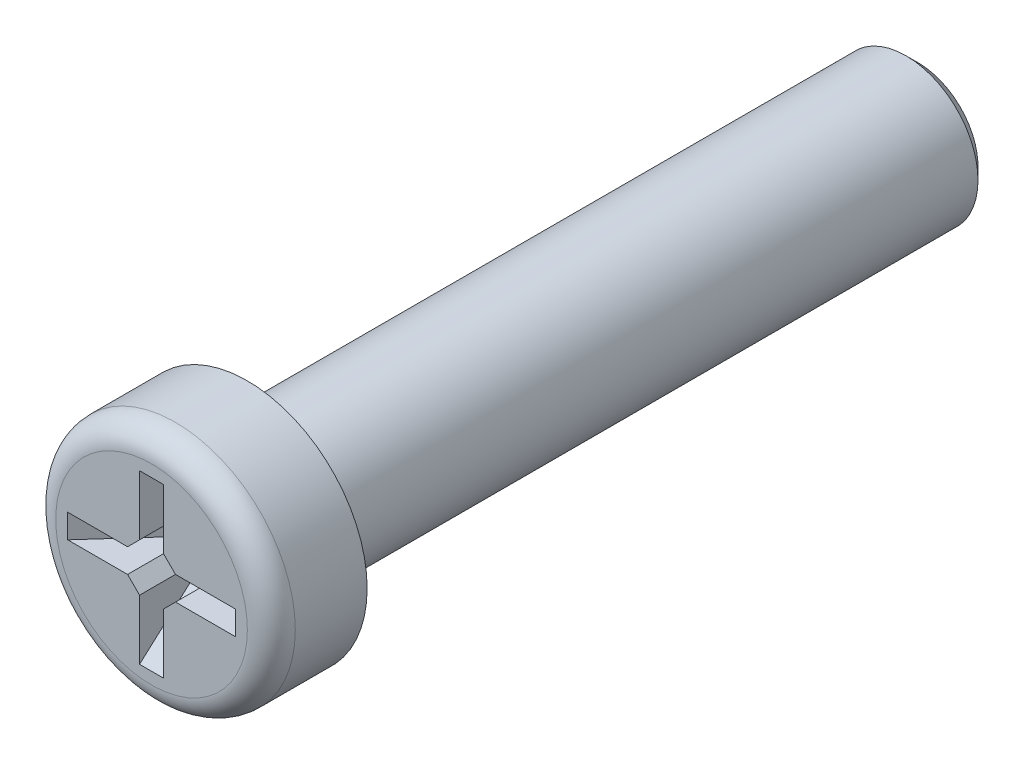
ISO-10303-21;
HEADER;
FILE_DESCRIPTION(('STEP AP214'),'2;1');
FILE_NAME('part.step','',(''),(''),'','','');
FILE_SCHEMA(('AUTOMOTIVE_DESIGN { 1 0 10303 214 1 1 1 1 }'));
ENDSEC;
DATA;
#1=APPLICATION_CONTEXT('core data for automotive mechanical design processes');
#2=APPLICATION_PROTOCOL_DEFINITION('international standard','automotive_design',2000,#1);
#3=PRODUCT_CONTEXT('',#1,'mechanical');
#4=PRODUCT('Part','Part','',(#3));
#5=PRODUCT_RELATED_PRODUCT_CATEGORY('part','',(#4));
#6=PRODUCT_DEFINITION_FORMATION('','',#4);
#7=PRODUCT_DEFINITION_CONTEXT('part definition',#1,'design');
#8=PRODUCT_DEFINITION('design','',#6,#7);
#9=PRODUCT_DEFINITION_SHAPE('','',#8);
#10=(LENGTH_UNIT() NAMED_UNIT(*) SI_UNIT(.MILLI.,.METRE.));
#11=(NAMED_UNIT(*) PLANE_ANGLE_UNIT() SI_UNIT($,.RADIAN.));
#12=(NAMED_UNIT(*) SI_UNIT($,.STERADIAN.) SOLID_ANGLE_UNIT());
#13=UNCERTAINTY_MEASURE_WITH_UNIT(LENGTH_MEASURE(1.E-05),#10,'distance_accuracy_value','');
#14=(GEOMETRIC_REPRESENTATION_CONTEXT(3) GLOBAL_UNCERTAINTY_ASSIGNED_CONTEXT((#13)) GLOBAL_UNIT_ASSIGNED_CONTEXT((#10,
#11,#12)) REPRESENTATION_CONTEXT('',''));
#15=CARTESIAN_POINT('',(0.,0.,0.));
#16=DIRECTION('',(0.,0.,1.));
#17=DIRECTION('',(1.,0.,0.));
#18=AXIS2_PLACEMENT_3D('',#15,#16,#17);
#19=CARTESIAN_POINT('',(1.75,0.25,2.));
#20=DIRECTION('',(-0.743144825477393,0.,0.669130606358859));
#21=DIRECTION('',(0.669130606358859,0.,0.743144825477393));
#22=AXIS2_PLACEMENT_3D('',#19,#20,#21);
#23=PLANE('',#22);
#24=DIRECTION('',(-0.669130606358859,0.,-0.743144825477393));
#25=VECTOR('',#24,1.);
#26=CARTESIAN_POINT('',(1.75,0.25,2.));
#27=LINE('',#26,#25);
#28=CARTESIAN_POINT('',(0.500000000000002,0.249999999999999,0.611734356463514));
#29=VERTEX_POINT('',#28);
#30=CARTESIAN_POINT('',(1.75,0.25,2.));
#31=VERTEX_POINT('',#30);
#32=EDGE_CURVE('E221',#29,#31,#27,.F.);
#33=ORIENTED_EDGE('',*,*,#32,.F.);
#34=DIRECTION('',(-0.556117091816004,0.556117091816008,-0.617630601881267));
#35=VECTOR('',#34,1.);
#36=CARTESIAN_POINT('',(1.36341722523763,-0.61341722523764,1.57065633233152));
#37=LINE('',#36,#35);
#38=CARTESIAN_POINT('',(0.375000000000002,0.375,0.472907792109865));
#39=VERTEX_POINT('',#38);
#40=EDGE_CURVE('E268',#29,#39,#37,.T.);
#41=ORIENTED_EDGE('',*,*,#40,.T.);
#42=DIRECTION('',(-0.556117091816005,-0.556117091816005,-0.617630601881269));
#43=VECTOR('',#42,1.);
#44=CARTESIAN_POINT('',(1.13146756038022,1.13146756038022,1.31305013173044));
#45=LINE('',#44,#43);
#46=CARTESIAN_POINT('',(0.0392323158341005,0.0392323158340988,0.1));
#47=VERTEX_POINT('',#46);
#48=EDGE_CURVE('E240',#39,#47,#45,.T.);
#49=ORIENTED_EDGE('',*,*,#48,.T.);
#50=DIRECTION('',(0.,-1.,0.));
#51=VECTOR('',#50,1.);
#52=CARTESIAN_POINT('',(0.0392323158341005,-0.249999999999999,0.1));
#53=LINE('',#52,#51);
#54=CARTESIAN_POINT('',(0.0392323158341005,-0.0392323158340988,0.1));
#55=VERTEX_POINT('',#54);
#56=EDGE_CURVE('E224',#55,#47,#53,.F.);
#57=ORIENTED_EDGE('',*,*,#56,.F.);
#58=DIRECTION('',(-0.556117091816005,0.556117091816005,-0.617630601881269));
#59=VECTOR('',#58,1.);
#60=CARTESIAN_POINT('',(1.13146756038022,-1.13146756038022,1.31305013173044));
#61=LINE('',#60,#59);
#62=CARTESIAN_POINT('',(0.375000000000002,-0.375,0.472907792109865));
#63=VERTEX_POINT('',#62);
#64=EDGE_CURVE('E55',#63,#55,#61,.T.);
#65=ORIENTED_EDGE('',*,*,#64,.F.);
#66=DIRECTION('',(0.556117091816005,0.556117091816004,0.617630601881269));
#67=VECTOR('',#66,1.);
#68=CARTESIAN_POINT('',(1.51805033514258,0.768050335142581,1.74239379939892));
#69=LINE('',#68,#67);
#70=CARTESIAN_POINT('',(0.500000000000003,-0.249999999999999,0.611734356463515));
#71=VERTEX_POINT('',#70);
#72=EDGE_CURVE('E279',#63,#71,#69,.T.);
#73=ORIENTED_EDGE('',*,*,#72,.T.);
#74=DIRECTION('',(-0.669130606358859,0.,-0.743144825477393));
#75=VECTOR('',#74,1.);
#76=CARTESIAN_POINT('',(0.133600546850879,-0.249999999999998,0.204806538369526));
#77=LINE('',#76,#75);
#78=CARTESIAN_POINT('',(1.75,-0.25,2.));
#79=VERTEX_POINT('',#78);
#80=EDGE_CURVE('E226',#71,#79,#77,.F.);
#81=ORIENTED_EDGE('',*,*,#80,.T.);
#82=DIRECTION('',(0.,1.,0.));
#83=VECTOR('',#82,1.);
#84=CARTESIAN_POINT('',(1.75,0.25,2.));
#85=LINE('',#84,#83);
#86=EDGE_CURVE('E188',#79,#31,#85,.T.);
#87=ORIENTED_EDGE('',*,*,#86,.T.);
#88=EDGE_LOOP('',(#33,#41,#49,#57,#65,#73,#81,#87));
#89=FACE_BOUND('',#88,.T.);
#90=ADVANCED_FACE('F32',(#89),#23,.T.);
#91=CARTESIAN_POINT('',(-0.250000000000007,1.75,2.));
#92=DIRECTION('',(0.,-0.743144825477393,0.669130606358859));
#93=DIRECTION('',(0.,-0.669130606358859,-0.743144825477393));
#94=AXIS2_PLACEMENT_3D('',#91,#92,#93);
#95=PLANE('',#94);
#96=ORIENTED_EDGE('',*,*,#48,.F.);
#97=DIRECTION('',(-0.556117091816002,0.556117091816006,0.61763060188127));
#98=VECTOR('',#97,1.);
#99=CARTESIAN_POINT('',(-0.768050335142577,1.51805033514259,1.74239379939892));
#100=LINE('',#99,#98);
#101=CARTESIAN_POINT('',(0.250000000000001,0.500000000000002,0.611734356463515));
#102=VERTEX_POINT('',#101);
#103=EDGE_CURVE('E271',#39,#102,#100,.T.);
#104=ORIENTED_EDGE('',*,*,#103,.T.);
#105=DIRECTION('',(0.,-0.669130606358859,-0.743144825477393));
#106=VECTOR('',#105,1.);
#107=CARTESIAN_POINT('',(0.250000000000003,0.80520419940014,0.950697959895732));
#108=LINE('',#107,#106);
#109=CARTESIAN_POINT('',(0.250000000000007,1.75,2.));
#110=VERTEX_POINT('',#109);
#111=EDGE_CURVE('E219',#102,#110,#108,.F.);
#112=ORIENTED_EDGE('',*,*,#111,.T.);
#113=DIRECTION('',(-1.,0.,0.));
#114=VECTOR('',#113,1.);
#115=CARTESIAN_POINT('',(-0.250000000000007,1.75,2.));
#116=LINE('',#115,#114);
#117=CARTESIAN_POINT('',(-0.250000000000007,1.75,2.));
#118=VERTEX_POINT('',#117);
#119=EDGE_CURVE('E197',#110,#118,#116,.T.);
#120=ORIENTED_EDGE('',*,*,#119,.T.);
#121=DIRECTION('',(0.,-0.669130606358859,-0.743144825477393));
#122=VECTOR('',#121,1.);
#123=CARTESIAN_POINT('',(-0.250000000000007,1.75,2.));
#124=LINE('',#123,#122);
#125=CARTESIAN_POINT('',(-0.250000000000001,0.5,0.611734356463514));
#126=VERTEX_POINT('',#125);
#127=EDGE_CURVE('E205',#126,#118,#124,.F.);
#128=ORIENTED_EDGE('',*,*,#127,.F.);
#129=DIRECTION('',(-0.556117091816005,-0.556117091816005,-0.617630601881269));
#130=VECTOR('',#129,1.);
#131=CARTESIAN_POINT('',(0.613417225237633,1.36341722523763,1.57065633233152));
#132=LINE('',#131,#130);
#133=CARTESIAN_POINT('',(-0.375000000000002,0.375,0.472907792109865));
#134=VERTEX_POINT('',#133);
#135=EDGE_CURVE('E273',#126,#134,#132,.T.);
#136=ORIENTED_EDGE('',*,*,#135,.T.);
#137=DIRECTION('',(0.556117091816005,-0.556117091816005,-0.617630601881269));
#138=VECTOR('',#137,1.);
#139=CARTESIAN_POINT('',(-1.28610067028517,1.28610067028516,1.48478759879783));
#140=LINE('',#139,#138);
#141=CARTESIAN_POINT('',(-0.0392323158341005,0.0392323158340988,0.1));
#142=VERTEX_POINT('',#141);
#143=EDGE_CURVE('E237',#134,#142,#140,.T.);
#144=ORIENTED_EDGE('',*,*,#143,.T.);
#145=DIRECTION('',(1.,0.,0.));
#146=VECTOR('',#145,1.);
#147=CARTESIAN_POINT('',(-0.249999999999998,0.0392323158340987,0.1));
#148=LINE('',#147,#146);
#149=EDGE_CURVE('E158',#47,#142,#148,.F.);
#150=ORIENTED_EDGE('',*,*,#149,.F.);
#151=EDGE_LOOP('',(#96,#104,#112,#120,#128,#136,#144,#150));
#152=FACE_BOUND('',#151,.T.);
#153=ADVANCED_FACE('F34',(#152),#95,.T.);
#154=CARTESIAN_POINT('',(-0.250000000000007,-1.75,2.));
#155=DIRECTION('',(0.,0.743144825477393,0.669130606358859));
#156=DIRECTION('',(0.,-0.669130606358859,0.743144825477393));
#157=AXIS2_PLACEMENT_3D('',#154,#155,#156);
#158=PLANE('',#157);
#159=DIRECTION('',(0.,0.669130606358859,-0.743144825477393));
#160=VECTOR('',#159,1.);
#161=CARTESIAN_POINT('',(0.250000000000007,-1.75,2.));
#162=LINE('',#161,#160);
#163=CARTESIAN_POINT('',(0.250000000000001,-0.5,0.611734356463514));
#164=VERTEX_POINT('',#163);
#165=CARTESIAN_POINT('',(0.250000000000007,-1.75,2.));
#166=VERTEX_POINT('',#165);
#167=EDGE_CURVE('E228',#164,#166,#162,.F.);
#168=ORIENTED_EDGE('',*,*,#167,.F.);
#169=DIRECTION('',(0.556117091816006,0.556117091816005,-0.617630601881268));
#170=VECTOR('',#169,1.);
#171=CARTESIAN_POINT('',(-0.768050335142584,-1.51805033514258,1.74239379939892));
#172=LINE('',#171,#170);
#173=EDGE_CURVE('E277',#164,#63,#172,.T.);
#174=ORIENTED_EDGE('',*,*,#173,.T.);
#175=ORIENTED_EDGE('',*,*,#64,.T.);
#176=DIRECTION('',(-1.,0.,0.));
#177=VECTOR('',#176,1.);
#178=CARTESIAN_POINT('',(-0.249999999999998,-0.0392323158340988,0.1));
#179=LINE('',#178,#177);
#180=CARTESIAN_POINT('',(-0.0392323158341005,-0.0392323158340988,0.1));
#181=VERTEX_POINT('',#180);
#182=EDGE_CURVE('E216',#181,#55,#179,.F.);
#183=ORIENTED_EDGE('',*,*,#182,.F.);
#184=DIRECTION('',(0.556117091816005,0.556117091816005,-0.617630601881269));
#185=VECTOR('',#184,1.);
#186=CARTESIAN_POINT('',(-1.28610067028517,-1.28610067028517,1.48478759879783));
#187=LINE('',#186,#185);
#188=CARTESIAN_POINT('',(-0.375000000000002,-0.375,0.472907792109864));
#189=VERTEX_POINT('',#188);
#190=EDGE_CURVE('E47',#189,#181,#187,.T.);
#191=ORIENTED_EDGE('',*,*,#190,.F.);
#192=DIRECTION('',(0.556117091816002,-0.556117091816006,0.61763060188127));
#193=VECTOR('',#192,1.);
#194=CARTESIAN_POINT('',(0.613417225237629,-1.36341722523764,1.57065633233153));
#195=LINE('',#194,#193);
#196=CARTESIAN_POINT('',(-0.250000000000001,-0.500000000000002,0.611734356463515));
#197=VERTEX_POINT('',#196);
#198=EDGE_CURVE('E283',#189,#197,#195,.T.);
#199=ORIENTED_EDGE('',*,*,#198,.T.);
#200=DIRECTION('',(0.,0.669130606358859,-0.743144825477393));
#201=VECTOR('',#200,1.);
#202=CARTESIAN_POINT('',(-0.25,-0.133600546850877,0.204806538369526));
#203=LINE('',#202,#201);
#204=CARTESIAN_POINT('',(-0.250000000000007,-1.75,2.));
#205=VERTEX_POINT('',#204);
#206=EDGE_CURVE('E218',#197,#205,#203,.F.);
#207=ORIENTED_EDGE('',*,*,#206,.T.);
#208=DIRECTION('',(1.,0.,0.));
#209=VECTOR('',#208,1.);
#210=CARTESIAN_POINT('',(-0.250000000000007,-1.75,2.));
#211=LINE('',#210,#209);
#212=EDGE_CURVE('E179',#205,#166,#211,.T.);
#213=ORIENTED_EDGE('',*,*,#212,.T.);
#214=EDGE_LOOP('',(#168,#174,#175,#183,#191,#199,#207,#213));
#215=FACE_BOUND('',#214,.T.);
#216=ADVANCED_FACE('F305',(#215),#158,.T.);
#217=CARTESIAN_POINT('',(-1.75,0.25,2.));
#218=DIRECTION('',(0.743144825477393,0.,0.669130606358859));
#219=DIRECTION('',(0.669130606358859,0.,-0.743144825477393));
#220=AXIS2_PLACEMENT_3D('',#217,#218,#219);
#221=PLANE('',#220);
#222=ORIENTED_EDGE('',*,*,#143,.F.);
#223=DIRECTION('',(-0.556117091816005,-0.556117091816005,0.617630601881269));
#224=VECTOR('',#223,1.);
#225=CARTESIAN_POINT('',(-1.36341722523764,-0.613417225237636,1.57065633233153));
#226=LINE('',#225,#224);
#227=CARTESIAN_POINT('',(-0.500000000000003,0.249999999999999,0.611734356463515));
#228=VERTEX_POINT('',#227);
#229=EDGE_CURVE('E153',#134,#228,#226,.T.);
#230=ORIENTED_EDGE('',*,*,#229,.T.);
#231=DIRECTION('',(0.669130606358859,0.,-0.743144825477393));
#232=VECTOR('',#231,1.);
#233=CARTESIAN_POINT('',(-0.805204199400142,0.249999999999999,0.950697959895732));
#234=LINE('',#233,#232);
#235=CARTESIAN_POINT('',(-1.75,0.25,2.));
#236=VERTEX_POINT('',#235);
#237=EDGE_CURVE('E145',#228,#236,#234,.F.);
#238=ORIENTED_EDGE('',*,*,#237,.T.);
#239=DIRECTION('',(0.,-1.,0.));
#240=VECTOR('',#239,1.);
#241=CARTESIAN_POINT('',(-1.75,0.25,2.));
#242=LINE('',#241,#240);
#243=CARTESIAN_POINT('',(-1.75,-0.25,2.));
#244=VERTEX_POINT('',#243);
#245=EDGE_CURVE('E150',#236,#244,#242,.T.);
#246=ORIENTED_EDGE('',*,*,#245,.T.);
#247=DIRECTION('',(0.669130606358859,0.,-0.743144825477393));
#248=VECTOR('',#247,1.);
#249=CARTESIAN_POINT('',(-1.75,-0.25,2.));
#250=LINE('',#249,#248);
#251=CARTESIAN_POINT('',(-0.500000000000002,-0.249999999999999,0.611734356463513));
#252=VERTEX_POINT('',#251);
#253=EDGE_CURVE('E157',#252,#244,#250,.F.);
#254=ORIENTED_EDGE('',*,*,#253,.F.);
#255=DIRECTION('',(0.556117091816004,-0.556117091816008,-0.617630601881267));
#256=VECTOR('',#255,1.);
#257=CARTESIAN_POINT('',(-1.51805033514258,0.768050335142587,1.74239379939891));
#258=LINE('',#257,#256);
#259=EDGE_CURVE('E281',#252,#189,#258,.T.);
#260=ORIENTED_EDGE('',*,*,#259,.T.);
#261=ORIENTED_EDGE('',*,*,#190,.T.);
#262=DIRECTION('',(0.,1.,0.));
#263=VECTOR('',#262,1.);
#264=CARTESIAN_POINT('',(-0.0392323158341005,-0.249999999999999,0.1));
#265=LINE('',#264,#263);
#266=EDGE_CURVE('E200',#142,#181,#265,.F.);
#267=ORIENTED_EDGE('',*,*,#266,.F.);
#268=EDGE_LOOP('',(#222,#230,#238,#246,#254,#260,#261,#267));
#269=FACE_BOUND('',#268,.T.);
#270=ADVANCED_FACE('F147',(#269),#221,.T.);
#271=CARTESIAN_POINT('',(0.,0.,0.));
#272=DIRECTION('',(0.,0.,1.));
#273=DIRECTION('',(1.,0.,0.));
#274=AXIS2_PLACEMENT_3D('',#271,#272,#273);
#275=PLANE('',#274);
#276=CARTESIAN_POINT('',(0.,0.,0.));
#277=DIRECTION('',(0.,0.,1.));
#278=DIRECTION('',(1.,0.,0.));
#279=AXIS2_PLACEMENT_3D('',#276,#277,#278);
#280=CIRCLE('',#279,2.5);
#281=CARTESIAN_POINT('',(2.5,0.,0.));
#282=VERTEX_POINT('',#281);
#283=EDGE_CURVE('E201',#282,#282,#280,.T.);
#284=ORIENTED_EDGE('',*,*,#283,.F.);
#285=EDGE_LOOP('',(#284));
#286=FACE_BOUND('',#285,.T.);
#287=CARTESIAN_POINT('',(0.,0.,0.));
#288=DIRECTION('',(0.,0.,1.));
#289=DIRECTION('',(1.,0.,0.));
#290=AXIS2_PLACEMENT_3D('',#287,#288,#289);
#291=CIRCLE('',#290,1.5);
#292=CARTESIAN_POINT('',(1.5,0.,0.));
#293=VERTEX_POINT('',#292);
#294=EDGE_CURVE('E204',#293,#293,#291,.F.);
#295=ORIENTED_EDGE('',*,*,#294,.F.);
#296=EDGE_LOOP('',(#295));
#297=FACE_BOUND('',#296,.T.);
#298=ADVANCED_FACE('F313',(#286,#297),#275,.F.);
#299=CARTESIAN_POINT('',(0.,0.,2.));
#300=DIRECTION('',(0.,0.,-1.));
#301=DIRECTION('',(-1.,0.,0.));
#302=AXIS2_PLACEMENT_3D('',#299,#300,#301);
#303=CYLINDRICAL_SURFACE('',#302,2.5);
#304=CARTESIAN_POINT('',(0.,0.,1.5));
#305=DIRECTION('',(0.,0.,1.));
#306=DIRECTION('',(1.,0.,0.));
#307=AXIS2_PLACEMENT_3D('',#304,#305,#306);
#308=CIRCLE('',#307,2.5);
#309=CARTESIAN_POINT('',(2.5,0.,1.5));
#310=VERTEX_POINT('',#309);
#311=EDGE_CURVE('E211',#310,#310,#308,.F.);
#312=ORIENTED_EDGE('',*,*,#311,.T.);
#313=EDGE_LOOP('',(#312));
#314=FACE_BOUND('',#313,.T.);
#315=ORIENTED_EDGE('',*,*,#283,.T.);
#316=EDGE_LOOP('',(#315));
#317=FACE_BOUND('',#316,.T.);
#318=ADVANCED_FACE('F314',(#314,#317),#303,.T.);
#319=CARTESIAN_POINT('',(0.,0.,2.));
#320=DIRECTION('',(0.,0.,1.));
#321=DIRECTION('',(1.,0.,0.));
#322=AXIS2_PLACEMENT_3D('',#319,#320,#321);
#323=PLANE('',#322);
#324=DIRECTION('',(0.,1.,0.));
#325=VECTOR('',#324,1.);
#326=CARTESIAN_POINT('',(0.250000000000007,1.75,2.));
#327=LINE('',#326,#325);
#328=CARTESIAN_POINT('',(0.250000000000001,0.500000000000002,2.));
#329=VERTEX_POINT('',#328);
#330=EDGE_CURVE('E194',#329,#110,#327,.T.);
#331=ORIENTED_EDGE('',*,*,#330,.F.);
#332=DIRECTION('',(-0.707106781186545,0.70710678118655,0.));
#333=VECTOR('',#332,1.);
#334=CARTESIAN_POINT('',(0.375000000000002,0.374999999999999,2.));
#335=LINE('',#334,#333);
#336=CARTESIAN_POINT('',(0.500000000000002,0.249999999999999,2.));
#337=VERTEX_POINT('',#336);
#338=EDGE_CURVE('E251',#329,#337,#335,.F.);
#339=ORIENTED_EDGE('',*,*,#338,.T.);
#340=DIRECTION('',(-1.,0.,0.));
#341=VECTOR('',#340,1.);
#342=CARTESIAN_POINT('',(0.25,0.249999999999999,2.));
#343=LINE('',#342,#341);
#344=EDGE_CURVE('E191',#31,#337,#343,.T.);
#345=ORIENTED_EDGE('',*,*,#344,.F.);
#346=ORIENTED_EDGE('',*,*,#86,.F.);
#347=DIRECTION('',(1.,0.,0.));
#348=VECTOR('',#347,1.);
#349=CARTESIAN_POINT('',(0.25,-0.249999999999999,2.));
#350=LINE('',#349,#348);
#351=CARTESIAN_POINT('',(0.500000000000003,-0.249999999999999,2.));
#352=VERTEX_POINT('',#351);
#353=EDGE_CURVE('E185',#352,#79,#350,.T.);
#354=ORIENTED_EDGE('',*,*,#353,.F.);
#355=DIRECTION('',(0.707106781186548,0.707106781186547,0.));
#356=VECTOR('',#355,1.);
#357=CARTESIAN_POINT('',(0.375000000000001,-0.375000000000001,2.));
#358=LINE('',#357,#356);
#359=CARTESIAN_POINT('',(0.250000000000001,-0.5,2.));
#360=VERTEX_POINT('',#359);
#361=EDGE_CURVE('E247',#352,#360,#358,.F.);
#362=ORIENTED_EDGE('',*,*,#361,.T.);
#363=DIRECTION('',(0.,1.,0.));
#364=VECTOR('',#363,1.);
#365=CARTESIAN_POINT('',(0.25,-0.249999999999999,2.));
#366=LINE('',#365,#364);
#367=EDGE_CURVE('E182',#166,#360,#366,.T.);
#368=ORIENTED_EDGE('',*,*,#367,.F.);
#369=ORIENTED_EDGE('',*,*,#212,.F.);
#370=DIRECTION('',(0.,-1.,0.));
#371=VECTOR('',#370,1.);
#372=CARTESIAN_POINT('',(-0.25,-0.249999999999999,2.));
#373=LINE('',#372,#371);
#374=CARTESIAN_POINT('',(-0.250000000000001,-0.500000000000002,2.));
#375=VERTEX_POINT('',#374);
#376=EDGE_CURVE('E173',#375,#205,#373,.T.);
#377=ORIENTED_EDGE('',*,*,#376,.F.);
#378=DIRECTION('',(0.707106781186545,-0.70710678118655,0.));
#379=VECTOR('',#378,1.);
#380=CARTESIAN_POINT('',(-0.375000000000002,-0.374999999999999,2.));
#381=LINE('',#380,#379);
#382=CARTESIAN_POINT('',(-0.500000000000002,-0.249999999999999,2.));
#383=VERTEX_POINT('',#382);
#384=EDGE_CURVE('E245',#375,#383,#381,.F.);
#385=ORIENTED_EDGE('',*,*,#384,.T.);
#386=DIRECTION('',(1.,0.,0.));
#387=VECTOR('',#386,1.);
#388=CARTESIAN_POINT('',(-1.75,-0.25,2.));
#389=LINE('',#388,#387);
#390=EDGE_CURVE('E171',#244,#383,#389,.T.);
#391=ORIENTED_EDGE('',*,*,#390,.F.);
#392=ORIENTED_EDGE('',*,*,#245,.F.);
#393=DIRECTION('',(-1.,0.,0.));
#394=VECTOR('',#393,1.);
#395=CARTESIAN_POINT('',(-1.75,0.25,2.));
#396=LINE('',#395,#394);
#397=CARTESIAN_POINT('',(-0.500000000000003,0.249999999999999,2.));
#398=VERTEX_POINT('',#397);
#399=EDGE_CURVE('E161',#398,#236,#396,.T.);
#400=ORIENTED_EDGE('',*,*,#399,.F.);
#401=DIRECTION('',(-0.707106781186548,-0.707106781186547,0.));
#402=VECTOR('',#401,1.);
#403=CARTESIAN_POINT('',(-0.375000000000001,0.375000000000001,2.));
#404=LINE('',#403,#402);
#405=CARTESIAN_POINT('',(-0.250000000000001,0.5,2.));
#406=VERTEX_POINT('',#405);
#407=EDGE_CURVE('E249',#398,#406,#404,.F.);
#408=ORIENTED_EDGE('',*,*,#407,.T.);
#409=DIRECTION('',(0.,-1.,0.));
#410=VECTOR('',#409,1.);
#411=CARTESIAN_POINT('',(-0.250000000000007,1.75,2.));
#412=LINE('',#411,#410);
#413=EDGE_CURVE('E165',#118,#406,#412,.T.);
#414=ORIENTED_EDGE('',*,*,#413,.F.);
#415=ORIENTED_EDGE('',*,*,#119,.F.);
#416=EDGE_LOOP('',(#331,#339,#345,#346,#354,#362,#368,#369,#377,#385,#391,#392,#400,#408,#414,#415));
#417=FACE_BOUND('',#416,.T.);
#418=CARTESIAN_POINT('',(0.,0.,2.));
#419=DIRECTION('',(0.,0.,1.));
#420=DIRECTION('',(1.,0.,0.));
#421=AXIS2_PLACEMENT_3D('',#418,#419,#420);
#422=CIRCLE('',#421,2.);
#423=CARTESIAN_POINT('',(2.,0.,2.));
#424=VERTEX_POINT('',#423);
#425=EDGE_CURVE('E208',#424,#424,#422,.T.);
#426=ORIENTED_EDGE('',*,*,#425,.T.);
#427=EDGE_LOOP('',(#426));
#428=FACE_BOUND('',#427,.T.);
#429=ADVANCED_FACE('F168',(#417,#428),#323,.T.);
#430=CARTESIAN_POINT('',(0.,0.,-14.));
#431=DIRECTION('',(0.,0.,1.));
#432=DIRECTION('',(1.,0.,0.));
#433=AXIS2_PLACEMENT_3D('',#430,#431,#432);
#434=CYLINDRICAL_SURFACE('',#433,1.5);
#435=CARTESIAN_POINT('',(0.,0.,-13.75));
#436=DIRECTION('',(0.,0.,-1.));
#437=DIRECTION('',(-1.,0.,0.));
#438=AXIS2_PLACEMENT_3D('',#435,#436,#437);
#439=CIRCLE('',#438,1.5);
#440=CARTESIAN_POINT('',(-1.5,0.,-13.75));
#441=VERTEX_POINT('',#440);
#442=EDGE_CURVE('E11',#441,#441,#439,.F.);
#443=ORIENTED_EDGE('',*,*,#442,.T.);
#444=EDGE_LOOP('',(#443));
#445=FACE_BOUND('',#444,.T.);
#446=ORIENTED_EDGE('',*,*,#294,.T.);
#447=EDGE_LOOP('',(#446));
#448=FACE_BOUND('',#447,.T.);
#449=ADVANCED_FACE('F320',(#445,#448),#434,.T.);
#450=CARTESIAN_POINT('',(0.,0.,-14.));
#451=DIRECTION('',(0.,0.,-1.));
#452=DIRECTION('',(-1.,0.,0.));
#453=AXIS2_PLACEMENT_3D('',#450,#451,#452);
#454=PLANE('',#453);
#455=CARTESIAN_POINT('',(0.,0.,-14.));
#456=DIRECTION('',(0.,0.,-1.));
#457=DIRECTION('',(-1.,0.,0.));
#458=AXIS2_PLACEMENT_3D('',#455,#456,#457);
#459=CIRCLE('',#458,1.25);
#460=CARTESIAN_POINT('',(-1.25,0.,-14.));
#461=VERTEX_POINT('',#460);
#462=EDGE_CURVE('E40',#461,#461,#459,.T.);
#463=ORIENTED_EDGE('',*,*,#462,.T.);
#464=EDGE_LOOP('',(#463));
#465=FACE_BOUND('',#464,.T.);
#466=ADVANCED_FACE('F287',(#465),#454,.T.);
#467=CARTESIAN_POINT('',(0.,0.,1.5));
#468=DIRECTION('',(0.,0.,1.));
#469=DIRECTION('',(1.,0.,0.));
#470=AXIS2_PLACEMENT_3D('',#467,#468,#469);
#471=TOROIDAL_SURFACE('',#470,2.,0.5);
#472=ORIENTED_EDGE('',*,*,#311,.F.);
#473=EDGE_LOOP('',(#472));
#474=FACE_BOUND('',#473,.T.);
#475=ORIENTED_EDGE('',*,*,#425,.F.);
#476=EDGE_LOOP('',(#475));
#477=FACE_BOUND('',#476,.T.);
#478=ADVANCED_FACE('F329',(#474,#477),#471,.T.);
#479=CARTESIAN_POINT('',(-0.250000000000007,1.75,0.1));
#480=DIRECTION('',(-1.,0.,0.));
#481=DIRECTION('',(0.,-1.,0.));
#482=AXIS2_PLACEMENT_3D('',#479,#480,#481);
#483=PLANE('',#482);
#484=ORIENTED_EDGE('',*,*,#413,.T.);
#485=DIRECTION('',(0.,0.,-1.));
#486=VECTOR('',#485,1.);
#487=CARTESIAN_POINT('',(-0.250000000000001,0.5,0.1));
#488=LINE('',#487,#486);
#489=EDGE_CURVE('E256',#406,#126,#488,.T.);
#490=ORIENTED_EDGE('',*,*,#489,.T.);
#491=ORIENTED_EDGE('',*,*,#127,.T.);
#492=EDGE_LOOP('',(#484,#490,#491));
#493=FACE_BOUND('',#492,.T.);
#494=ADVANCED_FACE('F332',(#493),#483,.F.);
#495=CARTESIAN_POINT('',(0.250000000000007,1.75,0.1));
#496=DIRECTION('',(1.,0.,0.));
#497=DIRECTION('',(0.,1.,0.));
#498=AXIS2_PLACEMENT_3D('',#495,#496,#497);
#499=PLANE('',#498);
#500=ORIENTED_EDGE('',*,*,#111,.F.);
#501=DIRECTION('',(0.,0.,1.));
#502=VECTOR('',#501,1.);
#503=CARTESIAN_POINT('',(0.250000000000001,0.500000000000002,0.1));
#504=LINE('',#503,#502);
#505=EDGE_CURVE('E242',#102,#329,#504,.T.);
#506=ORIENTED_EDGE('',*,*,#505,.T.);
#507=ORIENTED_EDGE('',*,*,#330,.T.);
#508=EDGE_LOOP('',(#500,#506,#507));
#509=FACE_BOUND('',#508,.T.);
#510=ADVANCED_FACE('F336',(#509),#499,.F.);
#511=CARTESIAN_POINT('',(0.25,0.249999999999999,0.1));
#512=DIRECTION('',(0.,1.,0.));
#513=DIRECTION('',(-1.,0.,0.));
#514=AXIS2_PLACEMENT_3D('',#511,#512,#513);
#515=PLANE('',#514);
#516=ORIENTED_EDGE('',*,*,#344,.T.);
#517=DIRECTION('',(0.,0.,-1.));
#518=VECTOR('',#517,1.);
#519=CARTESIAN_POINT('',(0.500000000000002,0.249999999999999,0.1));
#520=LINE('',#519,#518);
#521=EDGE_CURVE('E253',#337,#29,#520,.T.);
#522=ORIENTED_EDGE('',*,*,#521,.T.);
#523=ORIENTED_EDGE('',*,*,#32,.T.);
#524=EDGE_LOOP('',(#516,#522,#523));
#525=FACE_BOUND('',#524,.T.);
#526=ADVANCED_FACE('F356',(#525),#515,.F.);
#527=CARTESIAN_POINT('',(0.25,-0.249999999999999,0.1));
#528=DIRECTION('',(0.,-1.,0.));
#529=DIRECTION('',(1.,0.,0.));
#530=AXIS2_PLACEMENT_3D('',#527,#528,#529);
#531=PLANE('',#530);
#532=ORIENTED_EDGE('',*,*,#80,.F.);
#533=DIRECTION('',(0.,0.,1.));
#534=VECTOR('',#533,1.);
#535=CARTESIAN_POINT('',(0.500000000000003,-0.249999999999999,0.1));
#536=LINE('',#535,#534);
#537=EDGE_CURVE('E258',#71,#352,#536,.T.);
#538=ORIENTED_EDGE('',*,*,#537,.T.);
#539=ORIENTED_EDGE('',*,*,#353,.T.);
#540=EDGE_LOOP('',(#532,#538,#539));
#541=FACE_BOUND('',#540,.T.);
#542=ADVANCED_FACE('F352',(#541),#531,.F.);
#543=CARTESIAN_POINT('',(0.25,-0.249999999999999,0.1));
#544=DIRECTION('',(1.,0.,0.));
#545=DIRECTION('',(0.,1.,0.));
#546=AXIS2_PLACEMENT_3D('',#543,#544,#545);
#547=PLANE('',#546);
#548=ORIENTED_EDGE('',*,*,#367,.T.);
#549=DIRECTION('',(0.,0.,-1.));
#550=VECTOR('',#549,1.);
#551=CARTESIAN_POINT('',(0.250000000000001,-0.5,0.1));
#552=LINE('',#551,#550);
#553=EDGE_CURVE('E261',#360,#164,#552,.T.);
#554=ORIENTED_EDGE('',*,*,#553,.T.);
#555=ORIENTED_EDGE('',*,*,#167,.T.);
#556=EDGE_LOOP('',(#548,#554,#555));
#557=FACE_BOUND('',#556,.T.);
#558=ADVANCED_FACE('F348',(#557),#547,.F.);
#559=CARTESIAN_POINT('',(-0.25,-0.249999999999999,0.1));
#560=DIRECTION('',(-1.,0.,0.));
#561=DIRECTION('',(0.,-1.,0.));
#562=AXIS2_PLACEMENT_3D('',#559,#560,#561);
#563=PLANE('',#562);
#564=ORIENTED_EDGE('',*,*,#206,.F.);
#565=DIRECTION('',(0.,0.,1.));
#566=VECTOR('',#565,1.);
#567=CARTESIAN_POINT('',(-0.250000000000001,-0.500000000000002,0.1));
#568=LINE('',#567,#566);
#569=EDGE_CURVE('E263',#197,#375,#568,.T.);
#570=ORIENTED_EDGE('',*,*,#569,.T.);
#571=ORIENTED_EDGE('',*,*,#376,.T.);
#572=EDGE_LOOP('',(#564,#570,#571));
#573=FACE_BOUND('',#572,.T.);
#574=ADVANCED_FACE('F344',(#573),#563,.F.);
#575=CARTESIAN_POINT('',(-1.75,-0.25,0.1));
#576=DIRECTION('',(0.,-1.,0.));
#577=DIRECTION('',(1.,0.,0.));
#578=AXIS2_PLACEMENT_3D('',#575,#576,#577);
#579=PLANE('',#578);
#580=ORIENTED_EDGE('',*,*,#390,.T.);
#581=DIRECTION('',(0.,0.,-1.));
#582=VECTOR('',#581,1.);
#583=CARTESIAN_POINT('',(-0.500000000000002,-0.249999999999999,0.1));
#584=LINE('',#583,#582);
#585=EDGE_CURVE('E266',#383,#252,#584,.T.);
#586=ORIENTED_EDGE('',*,*,#585,.T.);
#587=ORIENTED_EDGE('',*,*,#253,.T.);
#588=EDGE_LOOP('',(#580,#586,#587));
#589=FACE_BOUND('',#588,.T.);
#590=ADVANCED_FACE('F341',(#589),#579,.F.);
#591=CARTESIAN_POINT('',(-1.75,0.25,0.1));
#592=DIRECTION('',(0.,1.,0.));
#593=DIRECTION('',(-1.,0.,0.));
#594=AXIS2_PLACEMENT_3D('',#591,#592,#593);
#595=PLANE('',#594);
#596=ORIENTED_EDGE('',*,*,#237,.F.);
#597=DIRECTION('',(0.,0.,1.));
#598=VECTOR('',#597,1.);
#599=CARTESIAN_POINT('',(-0.500000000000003,0.249999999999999,0.1));
#600=LINE('',#599,#598);
#601=EDGE_CURVE('E163',#228,#398,#600,.T.);
#602=ORIENTED_EDGE('',*,*,#601,.T.);
#603=ORIENTED_EDGE('',*,*,#399,.T.);
#604=EDGE_LOOP('',(#596,#602,#603));
#605=FACE_BOUND('',#604,.T.);
#606=ADVANCED_FACE('F162',(#605),#595,.F.);
#607=CARTESIAN_POINT('',(-0.249999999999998,-0.249999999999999,0.1));
#608=DIRECTION('',(0.,0.,1.));
#609=DIRECTION('',(1.,0.,0.));
#610=AXIS2_PLACEMENT_3D('',#607,#608,#609);
#611=PLANE('',#610);
#612=ORIENTED_EDGE('',*,*,#149,.T.);
#613=ORIENTED_EDGE('',*,*,#266,.T.);
#614=ORIENTED_EDGE('',*,*,#182,.T.);
#615=ORIENTED_EDGE('',*,*,#56,.T.);
#616=EDGE_LOOP('',(#612,#613,#614,#615));
#617=FACE_BOUND('',#616,.T.);
#618=ADVANCED_FACE('F340',(#617),#611,.T.);
#619=CARTESIAN_POINT('',(0.250000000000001,0.500000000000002,0.1));
#620=DIRECTION('',(0.70710678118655,0.707106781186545,0.));
#621=DIRECTION('',(-0.707106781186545,0.70710678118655,0.));
#622=AXIS2_PLACEMENT_3D('',#619,#620,#621);
#623=PLANE('',#622);
#624=ORIENTED_EDGE('',*,*,#40,.F.);
#625=ORIENTED_EDGE('',*,*,#521,.F.);
#626=ORIENTED_EDGE('',*,*,#338,.F.);
#627=ORIENTED_EDGE('',*,*,#505,.F.);
#628=ORIENTED_EDGE('',*,*,#103,.F.);
#629=EDGE_LOOP('',(#624,#625,#626,#627,#628));
#630=FACE_BOUND('',#629,.T.);
#631=ADVANCED_FACE('F366',(#630),#623,.F.);
#632=CARTESIAN_POINT('',(-0.500000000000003,0.249999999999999,0.1));
#633=DIRECTION('',(-0.707106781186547,0.707106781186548,0.));
#634=DIRECTION('',(-0.707106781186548,-0.707106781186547,0.));
#635=AXIS2_PLACEMENT_3D('',#632,#633,#634);
#636=PLANE('',#635);
#637=ORIENTED_EDGE('',*,*,#135,.F.);
#638=ORIENTED_EDGE('',*,*,#489,.F.);
#639=ORIENTED_EDGE('',*,*,#407,.F.);
#640=ORIENTED_EDGE('',*,*,#601,.F.);
#641=ORIENTED_EDGE('',*,*,#229,.F.);
#642=EDGE_LOOP('',(#637,#638,#639,#640,#641));
#643=FACE_BOUND('',#642,.T.);
#644=ADVANCED_FACE('F370',(#643),#636,.F.);
#645=CARTESIAN_POINT('',(0.500000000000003,-0.249999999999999,0.1));
#646=DIRECTION('',(0.707106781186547,-0.707106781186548,0.));
#647=DIRECTION('',(0.707106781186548,0.707106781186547,0.));
#648=AXIS2_PLACEMENT_3D('',#645,#646,#647);
#649=PLANE('',#648);
#650=ORIENTED_EDGE('',*,*,#173,.F.);
#651=ORIENTED_EDGE('',*,*,#553,.F.);
#652=ORIENTED_EDGE('',*,*,#361,.F.);
#653=ORIENTED_EDGE('',*,*,#537,.F.);
#654=ORIENTED_EDGE('',*,*,#72,.F.);
#655=EDGE_LOOP('',(#650,#651,#652,#653,#654));
#656=FACE_BOUND('',#655,.T.);
#657=ADVANCED_FACE('F297',(#656),#649,.F.);
#658=CARTESIAN_POINT('',(-0.250000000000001,-0.500000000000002,0.1));
#659=DIRECTION('',(-0.70710678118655,-0.707106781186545,0.));
#660=DIRECTION('',(0.707106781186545,-0.70710678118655,0.));
#661=AXIS2_PLACEMENT_3D('',#658,#659,#660);
#662=PLANE('',#661);
#663=ORIENTED_EDGE('',*,*,#259,.F.);
#664=ORIENTED_EDGE('',*,*,#585,.F.);
#665=ORIENTED_EDGE('',*,*,#384,.F.);
#666=ORIENTED_EDGE('',*,*,#569,.F.);
#667=ORIENTED_EDGE('',*,*,#198,.F.);
#668=EDGE_LOOP('',(#663,#664,#665,#666,#667));
#669=FACE_BOUND('',#668,.T.);
#670=ADVANCED_FACE('F291',(#669),#662,.F.);
#671=CARTESIAN_POINT('',(0.,0.,-14.));
#672=DIRECTION('',(0.,0.,1.));
#673=DIRECTION('',(1.,0.,0.));
#674=AXIS2_PLACEMENT_3D('',#671,#672,#673);
#675=CONICAL_SURFACE('',#674,1.25,0.785398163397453);
#676=ORIENTED_EDGE('',*,*,#442,.F.);
#677=EDGE_LOOP('',(#676));
#678=FACE_BOUND('',#677,.T.);
#679=ORIENTED_EDGE('',*,*,#462,.F.);
#680=EDGE_LOOP('',(#679));
#681=FACE_BOUND('',#680,.T.);
#682=ADVANCED_FACE('F289',(#678,#681),#675,.T.);
#683=CLOSED_SHELL('',(#90,#153,#216,#270,#298,#318,#429,#449,#466,#478,#494,#510,#526,#542,#558,
#574,#590,#606,#618,#631,#644,#657,#670,#682));
#684=MANIFOLD_SOLID_BREP('B2',#683);
#685=ADVANCED_BREP_SHAPE_REPRESENTATION('',(#18,#684),#14);
#686=SHAPE_DEFINITION_REPRESENTATION(#9,#685);
ENDSEC;
END-ISO-10303-21;
